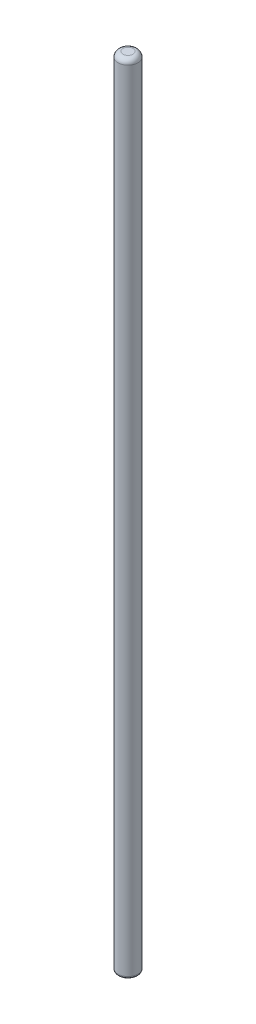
from build123d import *
from OCP.BRepFilletAPI import BRepFilletAPI_MakeFillet

# Parameters (mm, degrees)
SKETCH1_R           = 6.35
BOSS_EXTRUDE1_DEPTH = 508
FILLET1_R1          = 3.175
FILLET1_R2          = 1.5875


with BuildPart() as part:
    # Sketch1 → Boss-Extrude1 (new body)
    with BuildSketch(Plane(origin=(0, 0, 0), x_dir=(1, 0, 0), z_dir=(0, 1, 0))):
        with Locations(Location((0, 0, 0), (0, 0, 270))):
            Circle(SKETCH1_R)
    extrude(amount=BOSS_EXTRUDE1_DEPTH)

    # Fillet1: one fillet with a radius per group of edges: ONE call of the kernel's fillet builder (fillet() takes one radius for all edges)
    fillet1_edges_1 = [part.edges().sort_by_distance(p)[0] for p in [
        (0, 508, -6.35),
    ]]
    fillet1_edges_2 = [part.edges().sort_by_distance(p)[0] for p in [
        (0, 0, -6.35),
    ]]
    fillet1 = BRepFilletAPI_MakeFillet(part.part.solid().wrapped)
    for e in fillet1_edges_1:
        fillet1.Add(FILLET1_R1, e.wrapped)
    for e in fillet1_edges_2:
        fillet1.Add(FILLET1_R2, e.wrapped)
    add(Compound.cast(fillet1.Shape()), mode=Mode.REPLACE)


solid = part.part
